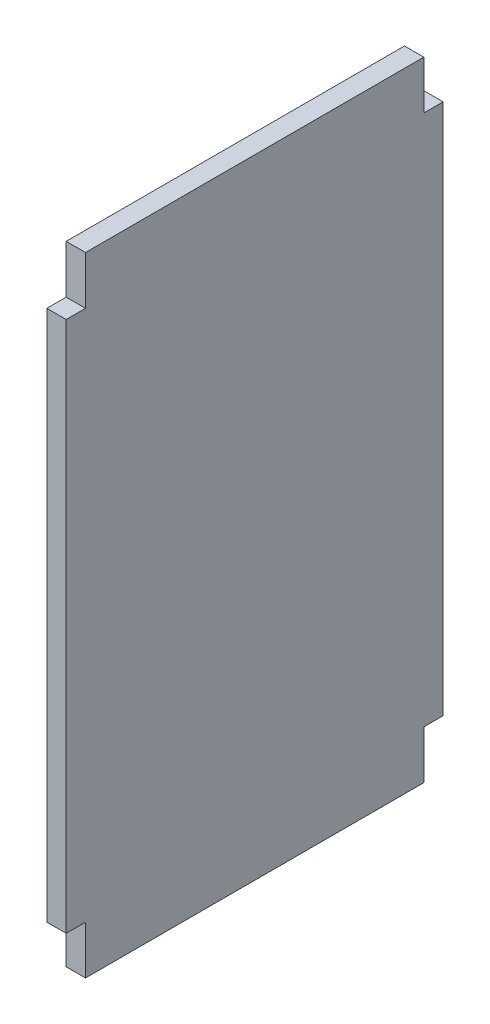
from build123d import *

# Parameters (mm, degrees)
SKETCH_1_W      = 35
SKETCH_1_H      = 65
SKETCH_1_W_2    = 2
SKETCH_1_H_2    = 55
EXTRUDE_1_DEPTH = 2


with BuildPart() as part:
    # Sketch 1 → Extrude 1 (new body)
    with BuildSketch(Plane(origin=(0, 0, 0), x_dir=(0, 0, -1), z_dir=(1, 0, 0))):
        with Locations((17.5, 32.5)):
            Rectangle(SKETCH_1_W, SKETCH_1_H)
        with Locations((-1, 32.5)):
            Rectangle(SKETCH_1_W_2, SKETCH_1_H_2)
        with Locations((36, 32.5)):
            Rectangle(SKETCH_1_W_2, SKETCH_1_H_2)
    extrude(amount=EXTRUDE_1_DEPTH)


solid = part.part
